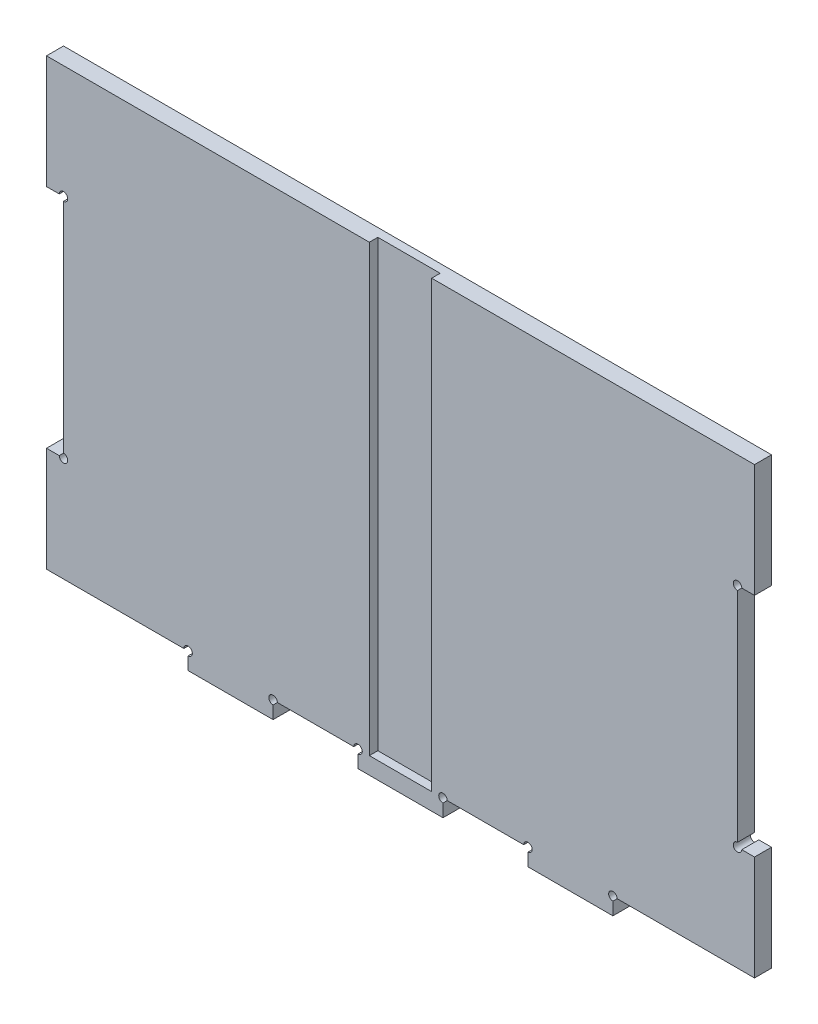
from build123d import *

# Parameters (mm, degrees)
BOSS_EXTRU_1_DEPTH      = 6
ESQUISSE3_R             = 1.5
ENL_V_MAT_EXTRU_1_DEPTH = 185.488482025
ESQUISSE4_W             = 22
ESQUISSE4_H             = 157
ENL_V_MAT_EXTRU_2_DEPTH = 3


with BuildPart() as part:
    # Esquisse2 → Boss.-Extru.1 (new body)
    with BuildSketch(Plane.XY):
        Polygon((-63.209106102, 120), (110, 120), (110, 80), (104, 80), (104, 0), (110, 0), (110, -37), (60, -37), (60, -43), (30, -43), (30, -37), (0, -37), (0, -43), (-30, -43), (-30, -37), (-60, -37), (-60, -43), (-90, -43), (-90, -37), (-140, -37), (-140, 0), (-134, 0), (-134, 80), (-140, 80), (-140, 120), align=None)
    extrude(amount=BOSS_EXTRU_1_DEPTH)

    # Esquisse3 → Enl_v. mat.-Extru.1 (cut, through all)
    with BuildSketch(Plane.XY.offset(6)):
        with Locations((-134, 80)):
            Circle(ESQUISSE3_R)
        with Locations((-134, 0)):
            Circle(ESQUISSE3_R)
        with Locations((-90, -37)):
            Circle(ESQUISSE3_R)
        with Locations((-60, -37)):
            Circle(ESQUISSE3_R)
        with Locations((-30, -37)):
            Circle(ESQUISSE3_R)
        with Locations((0, -37)):
            Circle(ESQUISSE3_R)
        with Locations((30, -37)):
            Circle(ESQUISSE3_R)
        with Locations((60, -37)):
            Circle(ESQUISSE3_R)
        with Locations((104, 0)):
            Circle(ESQUISSE3_R)
        with Locations((104, 80)):
            Circle(ESQUISSE3_R)
    extrude(amount=-ENL_V_MAT_EXTRU_1_DEPTH, mode=Mode.SUBTRACT)

    # Esquisse4 → Enl_v. mat.-Extru.2 (cut)
    with BuildSketch(Plane.XY.offset(6)):
        with Locations((-15, 41.5)):
            Rectangle(ESQUISSE4_W, ESQUISSE4_H)
    extrude(amount=-ENL_V_MAT_EXTRU_2_DEPTH, mode=Mode.SUBTRACT)


solid = part.part
